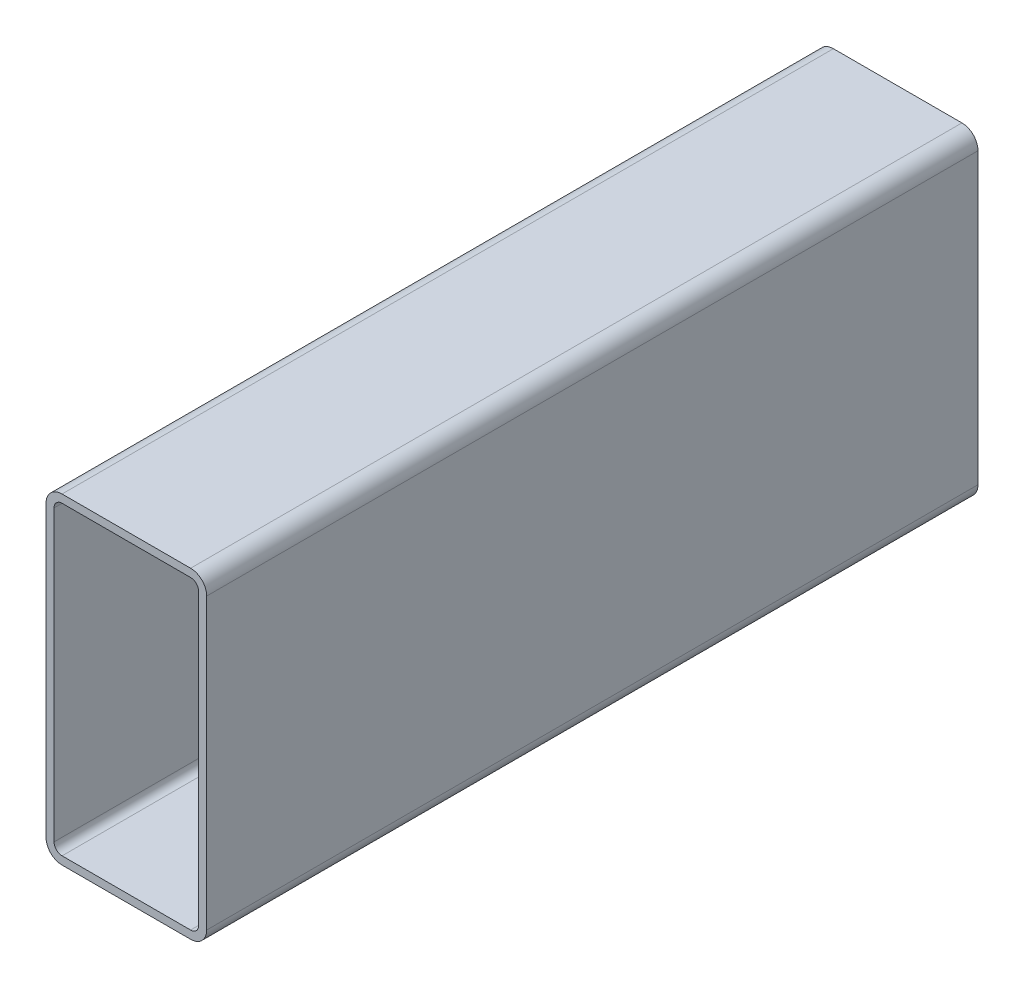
ISO-10303-21;
HEADER;
FILE_DESCRIPTION(('STEP AP214'),'2;1');
FILE_NAME('part.step','',(''),(''),'','','');
FILE_SCHEMA(('AUTOMOTIVE_DESIGN { 1 0 10303 214 1 1 1 1 }'));
ENDSEC;
DATA;
#1=APPLICATION_CONTEXT('core data for automotive mechanical design processes');
#2=APPLICATION_PROTOCOL_DEFINITION('international standard','automotive_design',2000,#1);
#3=PRODUCT_CONTEXT('',#1,'mechanical');
#4=PRODUCT('Part','Part','',(#3));
#5=PRODUCT_RELATED_PRODUCT_CATEGORY('part','',(#4));
#6=PRODUCT_DEFINITION_FORMATION('','',#4);
#7=PRODUCT_DEFINITION_CONTEXT('part definition',#1,'design');
#8=PRODUCT_DEFINITION('design','',#6,#7);
#9=PRODUCT_DEFINITION_SHAPE('','',#8);
#10=(LENGTH_UNIT() NAMED_UNIT(*) SI_UNIT(.MILLI.,.METRE.));
#11=(NAMED_UNIT(*) PLANE_ANGLE_UNIT() SI_UNIT($,.RADIAN.));
#12=(NAMED_UNIT(*) SI_UNIT($,.STERADIAN.) SOLID_ANGLE_UNIT());
#13=UNCERTAINTY_MEASURE_WITH_UNIT(LENGTH_MEASURE(1.E-05),#10,'distance_accuracy_value','');
#14=(GEOMETRIC_REPRESENTATION_CONTEXT(3) GLOBAL_UNCERTAINTY_ASSIGNED_CONTEXT((#13)) GLOBAL_UNIT_ASSIGNED_CONTEXT((#10,
#11,#12)) REPRESENTATION_CONTEXT('',''));
#15=CARTESIAN_POINT('',(0.,0.,0.));
#16=DIRECTION('',(0.,0.,1.));
#17=DIRECTION('',(1.,0.,0.));
#18=AXIS2_PLACEMENT_3D('',#15,#16,#17);
#19=CARTESIAN_POINT('',(9.24608514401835,122.68485662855,304.8));
#20=DIRECTION('',(0.,0.,1.));
#21=DIRECTION('',(1.,0.,0.));
#22=AXIS2_PLACEMENT_3D('',#19,#20,#21);
#23=PLANE('',#22);
#24=CARTESIAN_POINT('',(9.24608514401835,122.68485662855,304.8));
#25=DIRECTION('',(0.,0.,1.));
#26=DIRECTION('',(1.,0.,0.));
#27=AXIS2_PLACEMENT_3D('',#24,#25,#26);
#28=CIRCLE('',#27,6.35);
#29=CARTESIAN_POINT('',(9.24608514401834,129.03485662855,304.8));
#30=VERTEX_POINT('',#29);
#31=CARTESIAN_POINT('',(2.89608514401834,122.68485662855,304.8));
#32=VERTEX_POINT('',#31);
#33=EDGE_CURVE('E211',#30,#32,#28,.T.);
#34=ORIENTED_EDGE('',*,*,#33,.T.);
#35=DIRECTION('',(0.,-1.,0.));
#36=VECTOR('',#35,1.);
#37=CARTESIAN_POINT('',(2.89608514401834,8.38485662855,304.8));
#38=LINE('',#37,#36);
#39=CARTESIAN_POINT('',(2.89608514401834,8.38485662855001,304.8));
#40=VERTEX_POINT('',#39);
#41=EDGE_CURVE('E214',#32,#40,#38,.T.);
#42=ORIENTED_EDGE('',*,*,#41,.T.);
#43=CARTESIAN_POINT('',(9.24608514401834,8.38485662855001,304.8));
#44=DIRECTION('',(0.,0.,1.));
#45=DIRECTION('',(1.,0.,0.));
#46=AXIS2_PLACEMENT_3D('',#43,#44,#45);
#47=CIRCLE('',#46,6.35);
#48=CARTESIAN_POINT('',(9.24608514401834,2.03485662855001,304.8));
#49=VERTEX_POINT('',#48);
#50=EDGE_CURVE('E217',#40,#49,#47,.T.);
#51=ORIENTED_EDGE('',*,*,#50,.T.);
#52=DIRECTION('',(1.,0.,0.));
#53=VECTOR('',#52,1.);
#54=CARTESIAN_POINT('',(60.0460851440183,2.03485662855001,304.8));
#55=LINE('',#54,#53);
#56=CARTESIAN_POINT('',(60.0460851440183,2.03485662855,304.8));
#57=VERTEX_POINT('',#56);
#58=EDGE_CURVE('E219',#49,#57,#55,.T.);
#59=ORIENTED_EDGE('',*,*,#58,.T.);
#60=CARTESIAN_POINT('',(60.0460851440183,8.38485662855,304.8));
#61=DIRECTION('',(0.,0.,1.));
#62=DIRECTION('',(1.,0.,0.));
#63=AXIS2_PLACEMENT_3D('',#60,#61,#62);
#64=CIRCLE('',#63,6.35);
#65=CARTESIAN_POINT('',(66.3960851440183,8.38485662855,304.8));
#66=VERTEX_POINT('',#65);
#67=EDGE_CURVE('E221',#57,#66,#64,.T.);
#68=ORIENTED_EDGE('',*,*,#67,.T.);
#69=DIRECTION('',(0.,1.,0.));
#70=VECTOR('',#69,1.);
#71=CARTESIAN_POINT('',(66.3960851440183,122.68485662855,304.8));
#72=LINE('',#71,#70);
#73=CARTESIAN_POINT('',(66.3960851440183,122.68485662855,304.8));
#74=VERTEX_POINT('',#73);
#75=EDGE_CURVE('E223',#66,#74,#72,.T.);
#76=ORIENTED_EDGE('',*,*,#75,.T.);
#77=CARTESIAN_POINT('',(60.0460851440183,122.68485662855,304.8));
#78=DIRECTION('',(0.,0.,1.));
#79=DIRECTION('',(1.,0.,0.));
#80=AXIS2_PLACEMENT_3D('',#77,#78,#79);
#81=CIRCLE('',#80,6.35);
#82=CARTESIAN_POINT('',(60.0460851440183,129.03485662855,304.8));
#83=VERTEX_POINT('',#82);
#84=EDGE_CURVE('E225',#74,#83,#81,.T.);
#85=ORIENTED_EDGE('',*,*,#84,.T.);
#86=DIRECTION('',(-1.,0.,0.));
#87=VECTOR('',#86,1.);
#88=CARTESIAN_POINT('',(9.24608514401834,129.03485662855,304.8));
#89=LINE('',#88,#87);
#90=EDGE_CURVE('E227',#83,#30,#89,.T.);
#91=ORIENTED_EDGE('',*,*,#90,.T.);
#92=EDGE_LOOP('',(#34,#42,#51,#59,#68,#76,#85,#91));
#93=FACE_BOUND('',#92,.T.);
#94=DIRECTION('',(0.,-1.,0.));
#95=VECTOR('',#94,1.);
#96=CARTESIAN_POINT('',(6.07108514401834,8.38485662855,304.8));
#97=LINE('',#96,#95);
#98=CARTESIAN_POINT('',(6.07108514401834,122.68485662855,304.8));
#99=VERTEX_POINT('',#98);
#100=CARTESIAN_POINT('',(6.07108514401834,8.38485662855,304.8));
#101=VERTEX_POINT('',#100);
#102=EDGE_CURVE('E154',#99,#101,#97,.T.);
#103=ORIENTED_EDGE('',*,*,#102,.F.);
#104=CARTESIAN_POINT('',(9.24608514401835,122.68485662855,304.8));
#105=DIRECTION('',(0.,0.,1.));
#106=DIRECTION('',(1.,0.,0.));
#107=AXIS2_PLACEMENT_3D('',#104,#105,#106);
#108=CIRCLE('',#107,3.17500000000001);
#109=CARTESIAN_POINT('',(9.24608514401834,125.85985662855,304.8));
#110=VERTEX_POINT('',#109);
#111=EDGE_CURVE('E146',#110,#99,#108,.T.);
#112=ORIENTED_EDGE('',*,*,#111,.F.);
#113=DIRECTION('',(-1.,0.,0.));
#114=VECTOR('',#113,1.);
#115=CARTESIAN_POINT('',(9.24608514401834,125.85985662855,304.8));
#116=LINE('',#115,#114);
#117=CARTESIAN_POINT('',(60.0460851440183,125.85985662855,304.8));
#118=VERTEX_POINT('',#117);
#119=EDGE_CURVE('E179',#118,#110,#116,.T.);
#120=ORIENTED_EDGE('',*,*,#119,.F.);
#121=CARTESIAN_POINT('',(60.0460851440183,122.68485662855,304.8));
#122=DIRECTION('',(0.,0.,1.));
#123=DIRECTION('',(1.,0.,0.));
#124=AXIS2_PLACEMENT_3D('',#121,#122,#123);
#125=CIRCLE('',#124,3.17500000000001);
#126=CARTESIAN_POINT('',(63.2210851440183,122.68485662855,304.8));
#127=VERTEX_POINT('',#126);
#128=EDGE_CURVE('E177',#127,#118,#125,.T.);
#129=ORIENTED_EDGE('',*,*,#128,.F.);
#130=DIRECTION('',(0.,1.,0.));
#131=VECTOR('',#130,1.);
#132=CARTESIAN_POINT('',(63.2210851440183,122.68485662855,304.8));
#133=LINE('',#132,#131);
#134=CARTESIAN_POINT('',(63.2210851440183,8.38485662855,304.8));
#135=VERTEX_POINT('',#134);
#136=EDGE_CURVE('E175',#135,#127,#133,.T.);
#137=ORIENTED_EDGE('',*,*,#136,.F.);
#138=CARTESIAN_POINT('',(60.0460851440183,8.38485662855,304.8));
#139=DIRECTION('',(0.,0.,1.));
#140=DIRECTION('',(1.,0.,0.));
#141=AXIS2_PLACEMENT_3D('',#138,#139,#140);
#142=CIRCLE('',#141,3.175);
#143=CARTESIAN_POINT('',(60.0460851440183,5.20985662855,304.8));
#144=VERTEX_POINT('',#143);
#145=EDGE_CURVE('E173',#144,#135,#142,.T.);
#146=ORIENTED_EDGE('',*,*,#145,.F.);
#147=DIRECTION('',(1.,0.,0.));
#148=VECTOR('',#147,1.);
#149=CARTESIAN_POINT('',(60.0460851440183,5.20985662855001,304.8));
#150=LINE('',#149,#148);
#151=CARTESIAN_POINT('',(9.24608514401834,5.20985662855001,304.8));
#152=VERTEX_POINT('',#151);
#153=EDGE_CURVE('E169',#152,#144,#150,.T.);
#154=ORIENTED_EDGE('',*,*,#153,.F.);
#155=CARTESIAN_POINT('',(9.24608514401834,8.38485662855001,304.8));
#156=DIRECTION('',(0.,0.,1.));
#157=DIRECTION('',(1.,0.,0.));
#158=AXIS2_PLACEMENT_3D('',#155,#156,#157);
#159=CIRCLE('',#158,3.175);
#160=EDGE_CURVE('E167',#101,#152,#159,.T.);
#161=ORIENTED_EDGE('',*,*,#160,.F.);
#162=EDGE_LOOP('',(#103,#112,#120,#129,#137,#146,#154,#161));
#163=FACE_BOUND('',#162,.T.);
#164=ADVANCED_FACE('F33',(#93,#163),#23,.T.);
#165=CARTESIAN_POINT('',(9.24608514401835,122.68485662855,0.));
#166=DIRECTION('',(0.,0.,1.));
#167=DIRECTION('',(1.,0.,0.));
#168=AXIS2_PLACEMENT_3D('',#165,#166,#167);
#169=PLANE('',#168);
#170=CARTESIAN_POINT('',(9.24608514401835,122.68485662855,0.));
#171=DIRECTION('',(0.,0.,1.));
#172=DIRECTION('',(1.,0.,0.));
#173=AXIS2_PLACEMENT_3D('',#170,#171,#172);
#174=CIRCLE('',#173,6.35);
#175=CARTESIAN_POINT('',(9.24608514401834,129.03485662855,0.));
#176=VERTEX_POINT('',#175);
#177=CARTESIAN_POINT('',(2.89608514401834,122.68485662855,0.));
#178=VERTEX_POINT('',#177);
#179=EDGE_CURVE('E162',#176,#178,#174,.T.);
#180=ORIENTED_EDGE('',*,*,#179,.F.);
#181=DIRECTION('',(-1.,0.,0.));
#182=VECTOR('',#181,1.);
#183=CARTESIAN_POINT('',(9.24608514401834,129.03485662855,0.));
#184=LINE('',#183,#182);
#185=CARTESIAN_POINT('',(60.0460851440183,129.03485662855,0.));
#186=VERTEX_POINT('',#185);
#187=EDGE_CURVE('E215',#186,#176,#184,.T.);
#188=ORIENTED_EDGE('',*,*,#187,.F.);
#189=CARTESIAN_POINT('',(60.0460851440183,122.68485662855,0.));
#190=DIRECTION('',(0.,0.,1.));
#191=DIRECTION('',(1.,0.,0.));
#192=AXIS2_PLACEMENT_3D('',#189,#190,#191);
#193=CIRCLE('',#192,6.35);
#194=CARTESIAN_POINT('',(66.3960851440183,122.68485662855,0.));
#195=VERTEX_POINT('',#194);
#196=EDGE_CURVE('E242',#195,#186,#193,.T.);
#197=ORIENTED_EDGE('',*,*,#196,.F.);
#198=DIRECTION('',(0.,1.,0.));
#199=VECTOR('',#198,1.);
#200=CARTESIAN_POINT('',(66.3960851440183,122.68485662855,0.));
#201=LINE('',#200,#199);
#202=CARTESIAN_POINT('',(66.3960851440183,8.38485662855,0.));
#203=VERTEX_POINT('',#202);
#204=EDGE_CURVE('E240',#203,#195,#201,.T.);
#205=ORIENTED_EDGE('',*,*,#204,.F.);
#206=CARTESIAN_POINT('',(60.0460851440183,8.38485662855,0.));
#207=DIRECTION('',(0.,0.,1.));
#208=DIRECTION('',(1.,0.,0.));
#209=AXIS2_PLACEMENT_3D('',#206,#207,#208);
#210=CIRCLE('',#209,6.35);
#211=CARTESIAN_POINT('',(60.0460851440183,2.03485662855,0.));
#212=VERTEX_POINT('',#211);
#213=EDGE_CURVE('E238',#212,#203,#210,.T.);
#214=ORIENTED_EDGE('',*,*,#213,.F.);
#215=DIRECTION('',(1.,0.,0.));
#216=VECTOR('',#215,1.);
#217=CARTESIAN_POINT('',(60.0460851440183,2.03485662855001,0.));
#218=LINE('',#217,#216);
#219=CARTESIAN_POINT('',(9.24608514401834,2.03485662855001,0.));
#220=VERTEX_POINT('',#219);
#221=EDGE_CURVE('E236',#220,#212,#218,.T.);
#222=ORIENTED_EDGE('',*,*,#221,.F.);
#223=CARTESIAN_POINT('',(9.24608514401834,8.38485662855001,0.));
#224=DIRECTION('',(0.,0.,1.));
#225=DIRECTION('',(1.,0.,0.));
#226=AXIS2_PLACEMENT_3D('',#223,#224,#225);
#227=CIRCLE('',#226,6.35);
#228=CARTESIAN_POINT('',(2.89608514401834,8.38485662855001,0.));
#229=VERTEX_POINT('',#228);
#230=EDGE_CURVE('E234',#229,#220,#227,.T.);
#231=ORIENTED_EDGE('',*,*,#230,.F.);
#232=DIRECTION('',(0.,-1.,0.));
#233=VECTOR('',#232,1.);
#234=CARTESIAN_POINT('',(2.89608514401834,8.38485662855,0.));
#235=LINE('',#234,#233);
#236=EDGE_CURVE('E232',#178,#229,#235,.T.);
#237=ORIENTED_EDGE('',*,*,#236,.F.);
#238=EDGE_LOOP('',(#180,#188,#197,#205,#214,#222,#231,#237));
#239=FACE_BOUND('',#238,.T.);
#240=CARTESIAN_POINT('',(9.24608514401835,122.68485662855,0.));
#241=DIRECTION('',(0.,0.,1.));
#242=DIRECTION('',(1.,0.,0.));
#243=AXIS2_PLACEMENT_3D('',#240,#241,#242);
#244=CIRCLE('',#243,3.17500000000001);
#245=CARTESIAN_POINT('',(9.24608514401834,125.85985662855,0.));
#246=VERTEX_POINT('',#245);
#247=CARTESIAN_POINT('',(6.07108514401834,122.68485662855,0.));
#248=VERTEX_POINT('',#247);
#249=EDGE_CURVE('E56',#246,#248,#244,.T.);
#250=ORIENTED_EDGE('',*,*,#249,.T.);
#251=DIRECTION('',(0.,-1.,0.));
#252=VECTOR('',#251,1.);
#253=CARTESIAN_POINT('',(6.07108514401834,8.38485662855,0.));
#254=LINE('',#253,#252);
#255=CARTESIAN_POINT('',(6.07108514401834,8.38485662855,0.));
#256=VERTEX_POINT('',#255);
#257=EDGE_CURVE('E161',#248,#256,#254,.T.);
#258=ORIENTED_EDGE('',*,*,#257,.T.);
#259=CARTESIAN_POINT('',(9.24608514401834,8.38485662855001,0.));
#260=DIRECTION('',(0.,0.,1.));
#261=DIRECTION('',(1.,0.,0.));
#262=AXIS2_PLACEMENT_3D('',#259,#260,#261);
#263=CIRCLE('',#262,3.175);
#264=CARTESIAN_POINT('',(9.24608514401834,5.20985662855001,0.));
#265=VERTEX_POINT('',#264);
#266=EDGE_CURVE('E183',#256,#265,#263,.T.);
#267=ORIENTED_EDGE('',*,*,#266,.T.);
#268=DIRECTION('',(1.,0.,0.));
#269=VECTOR('',#268,1.);
#270=CARTESIAN_POINT('',(60.0460851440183,5.20985662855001,0.));
#271=LINE('',#270,#269);
#272=CARTESIAN_POINT('',(60.0460851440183,5.20985662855,0.));
#273=VERTEX_POINT('',#272);
#274=EDGE_CURVE('E186',#265,#273,#271,.T.);
#275=ORIENTED_EDGE('',*,*,#274,.T.);
#276=CARTESIAN_POINT('',(60.0460851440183,8.38485662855,0.));
#277=DIRECTION('',(0.,0.,1.));
#278=DIRECTION('',(1.,0.,0.));
#279=AXIS2_PLACEMENT_3D('',#276,#277,#278);
#280=CIRCLE('',#279,3.175);
#281=CARTESIAN_POINT('',(63.2210851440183,8.38485662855,0.));
#282=VERTEX_POINT('',#281);
#283=EDGE_CURVE('E189',#273,#282,#280,.T.);
#284=ORIENTED_EDGE('',*,*,#283,.T.);
#285=DIRECTION('',(0.,1.,0.));
#286=VECTOR('',#285,1.);
#287=CARTESIAN_POINT('',(63.2210851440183,122.68485662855,0.));
#288=LINE('',#287,#286);
#289=CARTESIAN_POINT('',(63.2210851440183,122.68485662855,0.));
#290=VERTEX_POINT('',#289);
#291=EDGE_CURVE('E192',#282,#290,#288,.T.);
#292=ORIENTED_EDGE('',*,*,#291,.T.);
#293=CARTESIAN_POINT('',(60.0460851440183,122.68485662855,0.));
#294=DIRECTION('',(0.,0.,1.));
#295=DIRECTION('',(1.,0.,0.));
#296=AXIS2_PLACEMENT_3D('',#293,#294,#295);
#297=CIRCLE('',#296,3.17500000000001);
#298=CARTESIAN_POINT('',(60.0460851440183,125.85985662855,0.));
#299=VERTEX_POINT('',#298);
#300=EDGE_CURVE('E195',#290,#299,#297,.T.);
#301=ORIENTED_EDGE('',*,*,#300,.T.);
#302=DIRECTION('',(-1.,0.,0.));
#303=VECTOR('',#302,1.);
#304=CARTESIAN_POINT('',(9.24608514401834,125.85985662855,0.));
#305=LINE('',#304,#303);
#306=EDGE_CURVE('E155',#299,#246,#305,.T.);
#307=ORIENTED_EDGE('',*,*,#306,.T.);
#308=EDGE_LOOP('',(#250,#258,#267,#275,#284,#292,#301,#307));
#309=FACE_BOUND('',#308,.T.);
#310=ADVANCED_FACE('F272',(#239,#309),#169,.F.);
#311=CARTESIAN_POINT('',(9.24608514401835,122.68485662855,304.8));
#312=DIRECTION('',(0.,0.,-1.));
#313=DIRECTION('',(-1.,0.,0.));
#314=AXIS2_PLACEMENT_3D('',#311,#312,#313);
#315=CYLINDRICAL_SURFACE('',#314,6.35);
#316=ORIENTED_EDGE('',*,*,#179,.T.);
#317=DIRECTION('',(0.,0.,-1.));
#318=VECTOR('',#317,1.);
#319=CARTESIAN_POINT('',(2.89608514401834,122.68485662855,304.8));
#320=LINE('',#319,#318);
#321=EDGE_CURVE('E11',#32,#178,#320,.T.);
#322=ORIENTED_EDGE('',*,*,#321,.F.);
#323=ORIENTED_EDGE('',*,*,#33,.F.);
#324=DIRECTION('',(0.,0.,-1.));
#325=VECTOR('',#324,1.);
#326=CARTESIAN_POINT('',(9.24608514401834,129.03485662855,304.8));
#327=LINE('',#326,#325);
#328=EDGE_CURVE('E229',#30,#176,#327,.T.);
#329=ORIENTED_EDGE('',*,*,#328,.T.);
#330=EDGE_LOOP('',(#316,#322,#323,#329));
#331=FACE_BOUND('',#330,.T.);
#332=ADVANCED_FACE('F35',(#331),#315,.T.);
#333=CARTESIAN_POINT('',(2.89608514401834,8.38485662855,304.8));
#334=DIRECTION('',(1.,0.,0.));
#335=DIRECTION('',(0.,0.,-1.));
#336=AXIS2_PLACEMENT_3D('',#333,#334,#335);
#337=PLANE('',#336);
#338=ORIENTED_EDGE('',*,*,#236,.T.);
#339=DIRECTION('',(0.,0.,-1.));
#340=VECTOR('',#339,1.);
#341=CARTESIAN_POINT('',(2.89608514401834,8.38485662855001,304.8));
#342=LINE('',#341,#340);
#343=EDGE_CURVE('E41',#40,#229,#342,.T.);
#344=ORIENTED_EDGE('',*,*,#343,.F.);
#345=ORIENTED_EDGE('',*,*,#41,.F.);
#346=ORIENTED_EDGE('',*,*,#321,.T.);
#347=EDGE_LOOP('',(#338,#344,#345,#346));
#348=FACE_BOUND('',#347,.T.);
#349=ADVANCED_FACE('F289',(#348),#337,.F.);
#350=CARTESIAN_POINT('',(9.24608514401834,8.38485662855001,304.8));
#351=DIRECTION('',(0.,0.,-1.));
#352=DIRECTION('',(-1.,0.,0.));
#353=AXIS2_PLACEMENT_3D('',#350,#351,#352);
#354=CYLINDRICAL_SURFACE('',#353,6.35);
#355=ORIENTED_EDGE('',*,*,#230,.T.);
#356=DIRECTION('',(0.,0.,-1.));
#357=VECTOR('',#356,1.);
#358=CARTESIAN_POINT('',(9.24608514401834,2.03485662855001,304.8));
#359=LINE('',#358,#357);
#360=EDGE_CURVE('E259',#49,#220,#359,.T.);
#361=ORIENTED_EDGE('',*,*,#360,.F.);
#362=ORIENTED_EDGE('',*,*,#50,.F.);
#363=ORIENTED_EDGE('',*,*,#343,.T.);
#364=EDGE_LOOP('',(#355,#361,#362,#363));
#365=FACE_BOUND('',#364,.T.);
#366=ADVANCED_FACE('F266',(#365),#354,.T.);
#367=CARTESIAN_POINT('',(60.0460851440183,2.03485662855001,304.8));
#368=DIRECTION('',(0.,1.,0.));
#369=DIRECTION('',(0.,0.,1.));
#370=AXIS2_PLACEMENT_3D('',#367,#368,#369);
#371=PLANE('',#370);
#372=ORIENTED_EDGE('',*,*,#221,.T.);
#373=DIRECTION('',(0.,0.,-1.));
#374=VECTOR('',#373,1.);
#375=CARTESIAN_POINT('',(60.0460851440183,2.03485662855,304.8));
#376=LINE('',#375,#374);
#377=EDGE_CURVE('E256',#57,#212,#376,.T.);
#378=ORIENTED_EDGE('',*,*,#377,.F.);
#379=ORIENTED_EDGE('',*,*,#58,.F.);
#380=ORIENTED_EDGE('',*,*,#360,.T.);
#381=EDGE_LOOP('',(#372,#378,#379,#380));
#382=FACE_BOUND('',#381,.T.);
#383=ADVANCED_FACE('F278',(#382),#371,.F.);
#384=CARTESIAN_POINT('',(60.0460851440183,8.38485662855,304.8));
#385=DIRECTION('',(0.,0.,-1.));
#386=DIRECTION('',(-1.,0.,0.));
#387=AXIS2_PLACEMENT_3D('',#384,#385,#386);
#388=CYLINDRICAL_SURFACE('',#387,6.35);
#389=ORIENTED_EDGE('',*,*,#213,.T.);
#390=DIRECTION('',(0.,0.,-1.));
#391=VECTOR('',#390,1.);
#392=CARTESIAN_POINT('',(66.3960851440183,8.38485662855,304.8));
#393=LINE('',#392,#391);
#394=EDGE_CURVE('E253',#66,#203,#393,.T.);
#395=ORIENTED_EDGE('',*,*,#394,.F.);
#396=ORIENTED_EDGE('',*,*,#67,.F.);
#397=ORIENTED_EDGE('',*,*,#377,.T.);
#398=EDGE_LOOP('',(#389,#395,#396,#397));
#399=FACE_BOUND('',#398,.T.);
#400=ADVANCED_FACE('F282',(#399),#388,.T.);
#401=CARTESIAN_POINT('',(66.3960851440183,122.68485662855,304.8));
#402=DIRECTION('',(-1.,0.,0.));
#403=DIRECTION('',(0.,0.,1.));
#404=AXIS2_PLACEMENT_3D('',#401,#402,#403);
#405=PLANE('',#404);
#406=ORIENTED_EDGE('',*,*,#204,.T.);
#407=DIRECTION('',(0.,0.,-1.));
#408=VECTOR('',#407,1.);
#409=CARTESIAN_POINT('',(66.3960851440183,122.68485662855,304.8));
#410=LINE('',#409,#408);
#411=EDGE_CURVE('E250',#74,#195,#410,.T.);
#412=ORIENTED_EDGE('',*,*,#411,.F.);
#413=ORIENTED_EDGE('',*,*,#75,.F.);
#414=ORIENTED_EDGE('',*,*,#394,.T.);
#415=EDGE_LOOP('',(#406,#412,#413,#414));
#416=FACE_BOUND('',#415,.T.);
#417=ADVANCED_FACE('F302',(#416),#405,.F.);
#418=CARTESIAN_POINT('',(60.0460851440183,122.68485662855,304.8));
#419=DIRECTION('',(0.,0.,-1.));
#420=DIRECTION('',(-1.,0.,0.));
#421=AXIS2_PLACEMENT_3D('',#418,#419,#420);
#422=CYLINDRICAL_SURFACE('',#421,6.35);
#423=ORIENTED_EDGE('',*,*,#196,.T.);
#424=DIRECTION('',(0.,0.,-1.));
#425=VECTOR('',#424,1.);
#426=CARTESIAN_POINT('',(60.0460851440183,129.03485662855,304.8));
#427=LINE('',#426,#425);
#428=EDGE_CURVE('E247',#83,#186,#427,.T.);
#429=ORIENTED_EDGE('',*,*,#428,.F.);
#430=ORIENTED_EDGE('',*,*,#84,.F.);
#431=ORIENTED_EDGE('',*,*,#411,.T.);
#432=EDGE_LOOP('',(#423,#429,#430,#431));
#433=FACE_BOUND('',#432,.T.);
#434=ADVANCED_FACE('F300',(#433),#422,.T.);
#435=CARTESIAN_POINT('',(9.24608514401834,129.03485662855,304.8));
#436=DIRECTION('',(0.,-1.,0.));
#437=DIRECTION('',(0.,0.,-1.));
#438=AXIS2_PLACEMENT_3D('',#435,#436,#437);
#439=PLANE('',#438);
#440=ORIENTED_EDGE('',*,*,#187,.T.);
#441=ORIENTED_EDGE('',*,*,#328,.F.);
#442=ORIENTED_EDGE('',*,*,#90,.F.);
#443=ORIENTED_EDGE('',*,*,#428,.T.);
#444=EDGE_LOOP('',(#440,#441,#442,#443));
#445=FACE_BOUND('',#444,.T.);
#446=ADVANCED_FACE('F295',(#445),#439,.F.);
#447=CARTESIAN_POINT('',(9.24608514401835,122.68485662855,304.8));
#448=DIRECTION('',(0.,0.,-1.));
#449=DIRECTION('',(-1.,0.,0.));
#450=AXIS2_PLACEMENT_3D('',#447,#448,#449);
#451=CYLINDRICAL_SURFACE('',#450,3.17500000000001);
#452=ORIENTED_EDGE('',*,*,#249,.F.);
#453=DIRECTION('',(0.,0.,-1.));
#454=VECTOR('',#453,1.);
#455=CARTESIAN_POINT('',(9.24608514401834,125.85985662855,304.8));
#456=LINE('',#455,#454);
#457=EDGE_CURVE('E150',#110,#246,#456,.T.);
#458=ORIENTED_EDGE('',*,*,#457,.F.);
#459=ORIENTED_EDGE('',*,*,#111,.T.);
#460=DIRECTION('',(0.,0.,-1.));
#461=VECTOR('',#460,1.);
#462=CARTESIAN_POINT('',(6.07108514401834,122.68485662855,304.8));
#463=LINE('',#462,#461);
#464=EDGE_CURVE('E149',#99,#248,#463,.T.);
#465=ORIENTED_EDGE('',*,*,#464,.T.);
#466=EDGE_LOOP('',(#452,#458,#459,#465));
#467=FACE_BOUND('',#466,.T.);
#468=ADVANCED_FACE('F148',(#467),#451,.F.);
#469=CARTESIAN_POINT('',(6.07108514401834,8.38485662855,304.8));
#470=DIRECTION('',(1.,0.,0.));
#471=DIRECTION('',(0.,0.,-1.));
#472=AXIS2_PLACEMENT_3D('',#469,#470,#471);
#473=PLANE('',#472);
#474=ORIENTED_EDGE('',*,*,#257,.F.);
#475=ORIENTED_EDGE('',*,*,#464,.F.);
#476=ORIENTED_EDGE('',*,*,#102,.T.);
#477=DIRECTION('',(0.,0.,-1.));
#478=VECTOR('',#477,1.);
#479=CARTESIAN_POINT('',(6.07108514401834,8.38485662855,304.8));
#480=LINE('',#479,#478);
#481=EDGE_CURVE('E163',#101,#256,#480,.T.);
#482=ORIENTED_EDGE('',*,*,#481,.T.);
#483=EDGE_LOOP('',(#474,#475,#476,#482));
#484=FACE_BOUND('',#483,.T.);
#485=ADVANCED_FACE('F158',(#484),#473,.T.);
#486=CARTESIAN_POINT('',(9.24608514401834,8.38485662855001,304.8));
#487=DIRECTION('',(0.,0.,-1.));
#488=DIRECTION('',(-1.,0.,0.));
#489=AXIS2_PLACEMENT_3D('',#486,#487,#488);
#490=CYLINDRICAL_SURFACE('',#489,3.175);
#491=ORIENTED_EDGE('',*,*,#266,.F.);
#492=ORIENTED_EDGE('',*,*,#481,.F.);
#493=ORIENTED_EDGE('',*,*,#160,.T.);
#494=DIRECTION('',(0.,0.,-1.));
#495=VECTOR('',#494,1.);
#496=CARTESIAN_POINT('',(9.24608514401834,5.20985662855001,304.8));
#497=LINE('',#496,#495);
#498=EDGE_CURVE('E208',#152,#265,#497,.T.);
#499=ORIENTED_EDGE('',*,*,#498,.T.);
#500=EDGE_LOOP('',(#491,#492,#493,#499));
#501=FACE_BOUND('',#500,.T.);
#502=ADVANCED_FACE('F327',(#501),#490,.F.);
#503=CARTESIAN_POINT('',(60.0460851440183,5.20985662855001,304.8));
#504=DIRECTION('',(0.,1.,0.));
#505=DIRECTION('',(0.,0.,1.));
#506=AXIS2_PLACEMENT_3D('',#503,#504,#505);
#507=PLANE('',#506);
#508=ORIENTED_EDGE('',*,*,#274,.F.);
#509=ORIENTED_EDGE('',*,*,#498,.F.);
#510=ORIENTED_EDGE('',*,*,#153,.T.);
#511=DIRECTION('',(0.,0.,-1.));
#512=VECTOR('',#511,1.);
#513=CARTESIAN_POINT('',(60.0460851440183,5.20985662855,304.8));
#514=LINE('',#513,#512);
#515=EDGE_CURVE('E206',#144,#273,#514,.T.);
#516=ORIENTED_EDGE('',*,*,#515,.T.);
#517=EDGE_LOOP('',(#508,#509,#510,#516));
#518=FACE_BOUND('',#517,.T.);
#519=ADVANCED_FACE('F331',(#518),#507,.T.);
#520=CARTESIAN_POINT('',(60.0460851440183,8.38485662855,304.8));
#521=DIRECTION('',(0.,0.,-1.));
#522=DIRECTION('',(-1.,0.,0.));
#523=AXIS2_PLACEMENT_3D('',#520,#521,#522);
#524=CYLINDRICAL_SURFACE('',#523,3.175);
#525=ORIENTED_EDGE('',*,*,#283,.F.);
#526=ORIENTED_EDGE('',*,*,#515,.F.);
#527=ORIENTED_EDGE('',*,*,#145,.T.);
#528=DIRECTION('',(0.,0.,-1.));
#529=VECTOR('',#528,1.);
#530=CARTESIAN_POINT('',(63.2210851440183,8.38485662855,304.8));
#531=LINE('',#530,#529);
#532=EDGE_CURVE('E204',#135,#282,#531,.T.);
#533=ORIENTED_EDGE('',*,*,#532,.T.);
#534=EDGE_LOOP('',(#525,#526,#527,#533));
#535=FACE_BOUND('',#534,.T.);
#536=ADVANCED_FACE('F337',(#535),#524,.F.);
#537=CARTESIAN_POINT('',(63.2210851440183,122.68485662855,304.8));
#538=DIRECTION('',(-1.,0.,0.));
#539=DIRECTION('',(0.,0.,1.));
#540=AXIS2_PLACEMENT_3D('',#537,#538,#539);
#541=PLANE('',#540);
#542=ORIENTED_EDGE('',*,*,#291,.F.);
#543=ORIENTED_EDGE('',*,*,#532,.F.);
#544=ORIENTED_EDGE('',*,*,#136,.T.);
#545=DIRECTION('',(0.,0.,-1.));
#546=VECTOR('',#545,1.);
#547=CARTESIAN_POINT('',(63.2210851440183,122.68485662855,304.8));
#548=LINE('',#547,#546);
#549=EDGE_CURVE('E202',#127,#290,#548,.T.);
#550=ORIENTED_EDGE('',*,*,#549,.T.);
#551=EDGE_LOOP('',(#542,#543,#544,#550));
#552=FACE_BOUND('',#551,.T.);
#553=ADVANCED_FACE('F341',(#552),#541,.T.);
#554=CARTESIAN_POINT('',(60.0460851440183,122.68485662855,304.8));
#555=DIRECTION('',(0.,0.,-1.));
#556=DIRECTION('',(-1.,0.,0.));
#557=AXIS2_PLACEMENT_3D('',#554,#555,#556);
#558=CYLINDRICAL_SURFACE('',#557,3.17500000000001);
#559=ORIENTED_EDGE('',*,*,#300,.F.);
#560=ORIENTED_EDGE('',*,*,#549,.F.);
#561=ORIENTED_EDGE('',*,*,#128,.T.);
#562=DIRECTION('',(0.,0.,-1.));
#563=VECTOR('',#562,1.);
#564=CARTESIAN_POINT('',(60.0460851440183,125.85985662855,304.8));
#565=LINE('',#564,#563);
#566=EDGE_CURVE('E48',#118,#299,#565,.T.);
#567=ORIENTED_EDGE('',*,*,#566,.T.);
#568=EDGE_LOOP('',(#559,#560,#561,#567));
#569=FACE_BOUND('',#568,.T.);
#570=ADVANCED_FACE('F345',(#569),#558,.F.);
#571=CARTESIAN_POINT('',(9.24608514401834,125.85985662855,304.8));
#572=DIRECTION('',(0.,-1.,0.));
#573=DIRECTION('',(0.,0.,-1.));
#574=AXIS2_PLACEMENT_3D('',#571,#572,#573);
#575=PLANE('',#574);
#576=ORIENTED_EDGE('',*,*,#306,.F.);
#577=ORIENTED_EDGE('',*,*,#566,.F.);
#578=ORIENTED_EDGE('',*,*,#119,.T.);
#579=ORIENTED_EDGE('',*,*,#457,.T.);
#580=EDGE_LOOP('',(#576,#577,#578,#579));
#581=FACE_BOUND('',#580,.T.);
#582=ADVANCED_FACE('F349',(#581),#575,.T.);
#583=CLOSED_SHELL('',(#164,#310,#332,#349,#366,#383,#400,#417,#434,#446,#468,#485,#502,#519,
#536,#553,#570,#582));
#584=MANIFOLD_SOLID_BREP('B2',#583);
#585=ADVANCED_BREP_SHAPE_REPRESENTATION('',(#18,#584),#14);
#586=SHAPE_DEFINITION_REPRESENTATION(#9,#585);
ENDSEC;
END-ISO-10303-21;
